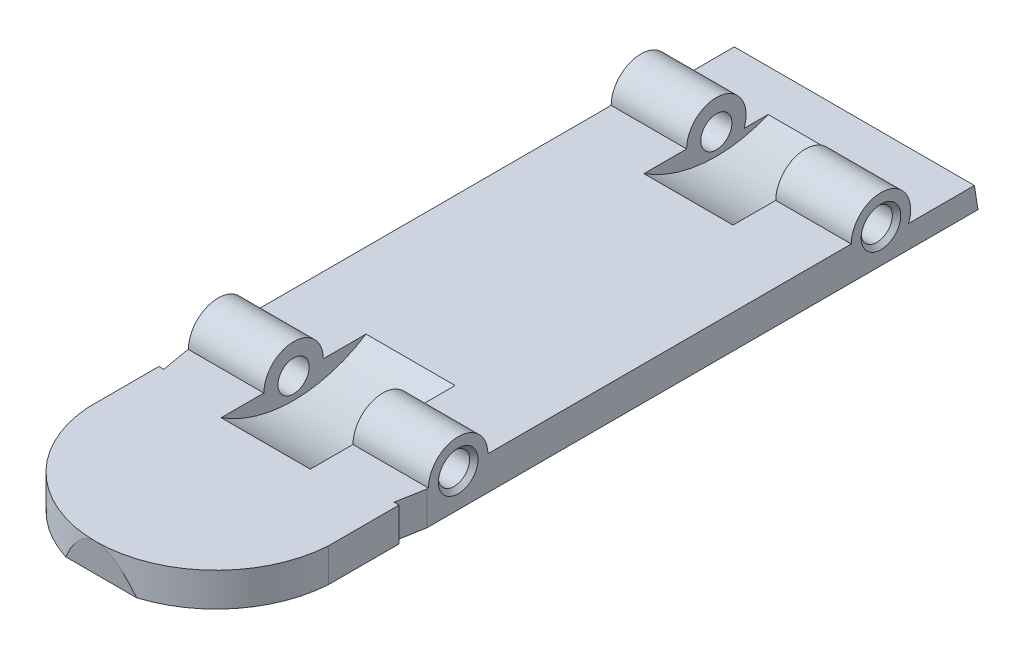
from build123d import *

# Parameters (mm, degrees)
SKETCH1_R           = 0.8001
BOSS_EXTRUDE1_DEPTH = 6.1595
CUT_EXTRUDE1_DEPTH  = 37.322461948
CUT_EXTRUDE2_DEPTH  = 12.319
SKETCH4_R           = 6.858
CUT_EXTRUDE3_DEPTH  = 2.286
CUT_EXTRUDE4_DEPTH  = 4.572


with BuildPart() as part:
    # Sketch1 → Boss-Extrude1 (new, symmetric)
    with BuildSketch(Plane(origin=(0, 0, 0), x_dir=(0, 0, -1), z_dir=(1, 0, 0))):
        with BuildLine():
            Line((-33.852385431, -1.7272), (4.979702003, -1.7272))
            Line((4.979702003, -1.7272), (4.706140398, 0))
            Line((4.706140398, 0), (1.524, 0))
            ThreePointArc((1.524, 0), (0, 1.524), (-1.524, 0))
            Line((-1.524, 0), (-20.1676, 0))
            ThreePointArc((-20.1676, 0), (-21.6916, 1.524), (-23.2156, 0))
            Line((-23.2156, 0), (-34.125947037, 0))
            Line((-34.125947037, 0), (-33.852385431, -1.7272))
        make_face()
        with Locations(Location((0, 0, 0), (0, 0, 180))):
            Circle(SKETCH1_R, mode=Mode.SUBTRACT)
        with Locations(Location((-21.6916, 0, 0), (0, 0, 180))):
            Circle(SKETCH1_R, mode=Mode.SUBTRACT)
    extrude(amount=BOSS_EXTRUDE1_DEPTH, both=True)

    # Sketch2 → Cut-Extrude1 (cut, through all)
    with BuildSketch(Plane(origin=(6.1595, 0, 0), x_dir=(0, 0, -1), z_dir=(1, 0, 0))):
        with BuildLine():
            Line((4.706140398, 0), (1.524, 0))
            ThreePointArc((1.524, 0), (1.497229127, -0.28439575), (1.417857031, -0.5588))
            Line((1.417857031, -0.5588), (4.794645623, -0.5588))
            Line((4.794645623, -0.5588), (4.706140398, 0))
        make_face()
    extrude(amount=-CUT_EXTRUDE1_DEPTH, mode=Mode.SUBTRACT)

    # Sketch3 → Cut-Extrude2 (cut)
    with BuildSketch(Plane(origin=(0, 0, 0), x_dir=(1, 0, 0), z_dir=(0, 1, 0))):
        with BuildLine():
            ThreePointArc((0, -34.125947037), (-4.222170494, -32.455894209), (-6.1595, -28.349490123))
            Line((-6.1595, -28.349490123), (-6.1595, -34.125947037))
            Line((-6.1595, -34.125947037), (0, -34.125947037))
        make_face()
        with BuildLine():
            ThreePointArc((6.1595, -28.349490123), (4.222170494, -32.455894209), (0, -34.125947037))
            Line((0, -34.125947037), (6.1595, -34.125947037))
            Line((6.1595, -34.125947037), (6.1595, -28.349490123))
        make_face()
    extrude(amount=-CUT_EXTRUDE2_DEPTH, mode=Mode.SUBTRACT)

    # Sketch4 → Cut-Extrude3 (cut, symmetric)
    with BuildSketch(Plane(origin=(0, 0, 0), x_dir=(0, 0, -1), z_dir=(1, 0, 0))):
        with Locations((-21.6916, 5.763489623)):
            Circle(SKETCH4_R)
        with Locations((0, 5.763489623)):
            Circle(SKETCH4_R)
    extrude(amount=CUT_EXTRUDE3_DEPTH, both=True, mode=Mode.SUBTRACT)

    # Sketch5 → Cut-Extrude4 (cut)
    with BuildSketch(Plane.XZ.offset(1.7272)):
        Polygon((6.1595, 23.287441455), (5.9055, 24.727947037), (6.1595, 24.727947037), align=None)
        Polygon((-5.9055, 24.727947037), (-6.1595, 24.727947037), (-6.1595, 23.287441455), align=None)
    extrude(amount=-CUT_EXTRUDE4_DEPTH, mode=Mode.SUBTRACT)

    # Sketch9 → Cut-Revolve1 (revolve, cut)
    with BuildSketch(Plane.XY.offset(21.6916), mode=Mode.PRIVATE) as cut_revolve1_sk:
        Polygon((6.1595, 0.8001), (5.943484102, 0.8001), (6.1595, 1.016115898), align=None)
    cut_revolve1 = revolve(cut_revolve1_sk.sketch.rotate(Axis((6.1595, 0, 21.6916), (-1, 0, 0)), 270), axis=Axis((6.1595, 0, 21.6916), (-1, 0, 0)), mode=Mode.SUBTRACT)

    # Mirror1: Cut-Revolve1 across plane
    add(cut_revolve1.mirror(Plane(origin=(0, 0, 0), x_dir=(0, 0, 1), z_dir=(1, 0, 0))), mode=Mode.SUBTRACT)

    # Mirror2: Cut-Revolve1 across plane
    add(cut_revolve1.mirror(Plane.XY.offset(10.8458)), mode=Mode.SUBTRACT)

    # Mirror2 copy 1 sketch → Mirror2 copy 1 (revolve, cut)
    with BuildSketch(Plane(origin=(0, 0, 0), x_dir=(-1, 0, 0), z_dir=(0, 0, -1))):
        Polygon((6.1595, 0.8001), (5.943484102, 0.8001), (6.1595, 1.016115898), align=None)
    revolve(axis=Axis((-6.1595, 0, 0), (1, 0, 0)), mode=Mode.SUBTRACT)


solid = part.part
